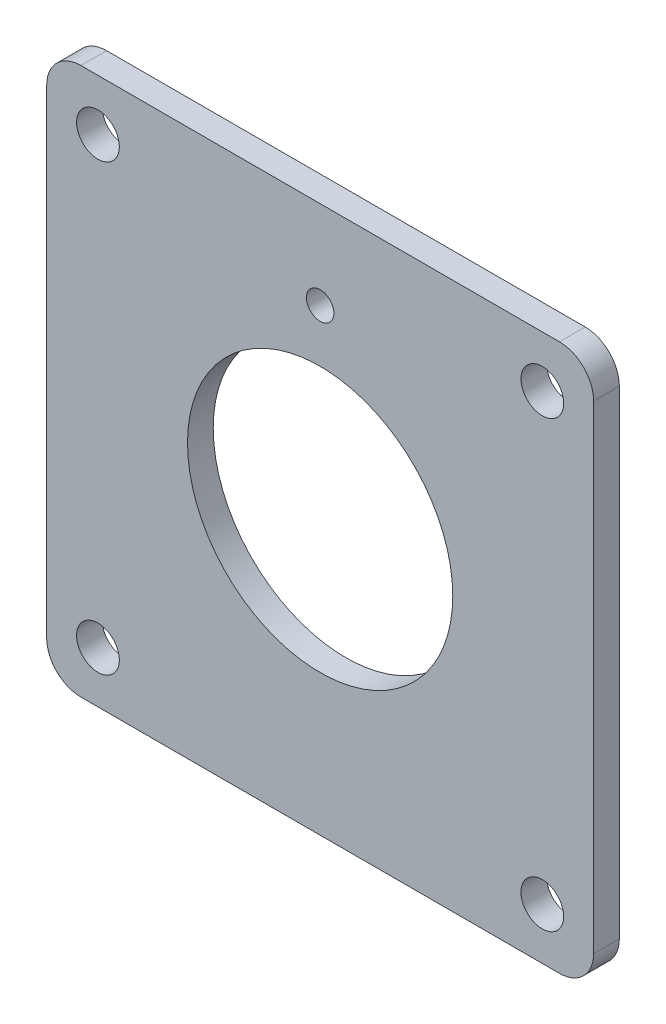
from build123d import *

# Parameters (mm, degrees)
BOSS_EXTRUDE1_DEPTH            = 4.7752
SKETCH3_R                      = 24.638
CUT_EXTRUDE1_DEPTH             = 73.000573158
F_5_16_0_3125_DIAMETER_HOLE1_D = 7.9375
TAP_DRILL_FOR_1_4_20_TAP2_D    = 5.1054


with BuildPart() as part:
    # Sketch1 → Boss-Extrude1 (new body)
    with BuildSketch(Plane.XY):
        with BuildLine():
            Line((-50.8, 44.45), (-50.8, -44.45))
            ThreePointArc((-50.8, -44.45), (-48.940128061, -48.940128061), (-44.45, -50.8))
            Line((-44.45, -50.8), (44.45, -50.8))
            ThreePointArc((44.45, -50.8), (48.940128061, -48.940128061), (50.8, -44.45))
            Line((50.8, -44.45), (50.8, 44.45))
            ThreePointArc((50.8, 44.45), (48.940128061, 48.940128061), (44.45, 50.8))
            Line((44.45, 50.8), (-44.45, 50.8))
            ThreePointArc((-44.45, 50.8), (-48.940128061, 48.940128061), (-50.8, 44.45))
        make_face()
    extrude(amount=BOSS_EXTRUDE1_DEPTH)

    # Sketch3 → Cut-Extrude1 (cut, through all)
    with BuildSketch(Plane.XY):
        Circle(SKETCH3_R)
    extrude(amount=CUT_EXTRUDE1_DEPTH, mode=Mode.SUBTRACT)

    # 5_16 _0.3125_ Diameter Hole1 (through all)
    with Locations(Plane(origin=(0, 0, 0), x_dir=(1, 0, 0), z_dir=(0, 0, -1))):
        with Locations((-41.275, -41.275), (41.275, -41.275), (41.275, 41.275), (-41.275, 41.275)):
            Hole(F_5_16_0_3125_DIAMETER_HOLE1_D / 2)

    # Tap Drill for 1_4-20 Tap2 (through all)
    with Locations(Plane(origin=(0, 0, 0), x_dir=(-1, 0, 0), z_dir=(0, 0, -1))):
        with Locations((0, 34.417)):
            Hole(TAP_DRILL_FOR_1_4_20_TAP2_D / 2)


solid = part.part
